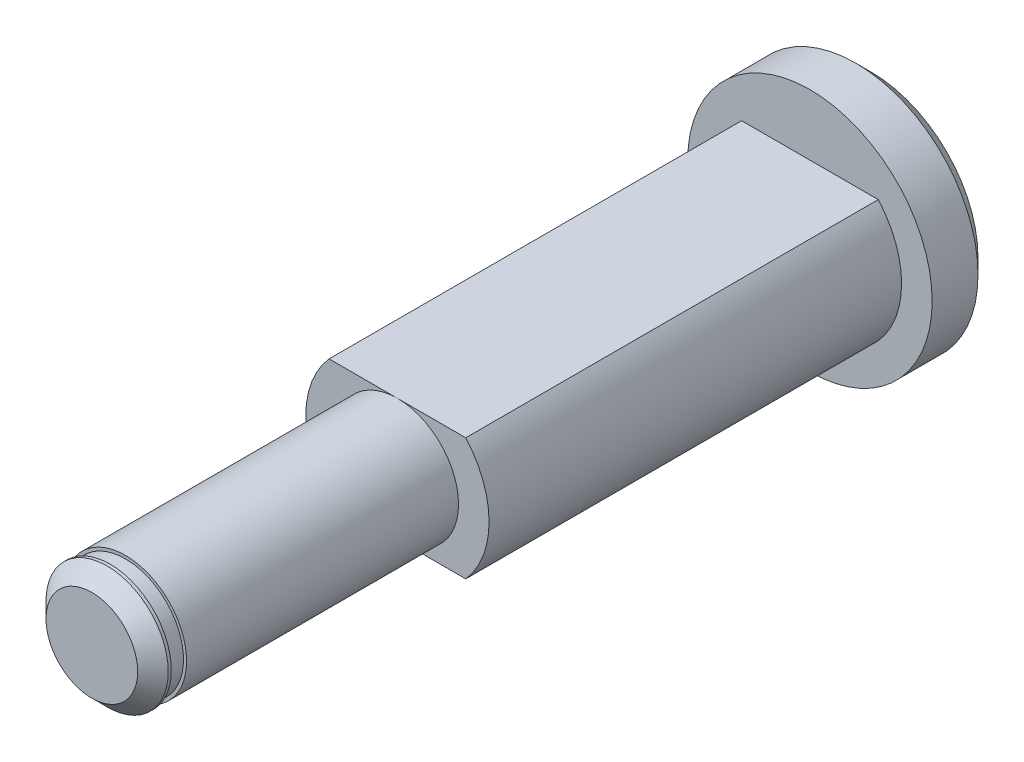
ISO-10303-21;
HEADER;
FILE_DESCRIPTION(('STEP AP214'),'2;1');
FILE_NAME('part.step','',(''),(''),'','','');
FILE_SCHEMA(('AUTOMOTIVE_DESIGN { 1 0 10303 214 1 1 1 1 }'));
ENDSEC;
DATA;
#1=APPLICATION_CONTEXT('core data for automotive mechanical design processes');
#2=APPLICATION_PROTOCOL_DEFINITION('international standard','automotive_design',2000,#1);
#3=PRODUCT_CONTEXT('',#1,'mechanical');
#4=PRODUCT('Part','Part','',(#3));
#5=PRODUCT_RELATED_PRODUCT_CATEGORY('part','',(#4));
#6=PRODUCT_DEFINITION_FORMATION('','',#4);
#7=PRODUCT_DEFINITION_CONTEXT('part definition',#1,'design');
#8=PRODUCT_DEFINITION('design','',#6,#7);
#9=PRODUCT_DEFINITION_SHAPE('','',#8);
#10=(LENGTH_UNIT() NAMED_UNIT(*) SI_UNIT(.MILLI.,.METRE.));
#11=(NAMED_UNIT(*) PLANE_ANGLE_UNIT() SI_UNIT($,.RADIAN.));
#12=(NAMED_UNIT(*) SI_UNIT($,.STERADIAN.) SOLID_ANGLE_UNIT());
#13=UNCERTAINTY_MEASURE_WITH_UNIT(LENGTH_MEASURE(1.E-05),#10,'distance_accuracy_value','');
#14=(GEOMETRIC_REPRESENTATION_CONTEXT(3) GLOBAL_UNCERTAINTY_ASSIGNED_CONTEXT((#13)) GLOBAL_UNIT_ASSIGNED_CONTEXT((#10,
#11,#12)) REPRESENTATION_CONTEXT('',''));
#15=CARTESIAN_POINT('',(0.,0.,0.));
#16=DIRECTION('',(0.,0.,1.));
#17=DIRECTION('',(1.,0.,0.));
#18=AXIS2_PLACEMENT_3D('',#15,#16,#17);
#19=CARTESIAN_POINT('',(0.,0.,0.));
#20=DIRECTION('',(0.,0.,1.));
#21=DIRECTION('',(1.,0.,0.));
#22=AXIS2_PLACEMENT_3D('',#19,#20,#21);
#23=PLANE('',#22);
#24=CARTESIAN_POINT('',(0.,0.,0.));
#25=DIRECTION('',(0.,0.,1.));
#26=DIRECTION('',(1.,0.,0.));
#27=AXIS2_PLACEMENT_3D('',#24,#25,#26);
#28=CIRCLE('',#27,3.);
#29=CARTESIAN_POINT('',(2.23606797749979,-2.,0.));
#30=VERTEX_POINT('',#29);
#31=CARTESIAN_POINT('',(2.23606797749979,2.,0.));
#32=VERTEX_POINT('',#31);
#33=EDGE_CURVE('E102',#30,#32,#28,.T.);
#34=ORIENTED_EDGE('',*,*,#33,.T.);
#35=DIRECTION('',(-1.,0.,0.));
#36=VECTOR('',#35,1.);
#37=CARTESIAN_POINT('',(-3.78673646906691,2.,0.));
#38=LINE('',#37,#36);
#39=CARTESIAN_POINT('',(0.,2.,0.));
#40=VERTEX_POINT('',#39);
#41=EDGE_CURVE('E90',#32,#40,#38,.T.);
#42=ORIENTED_EDGE('',*,*,#41,.T.);
#43=CARTESIAN_POINT('',(0.,0.,0.));
#44=DIRECTION('',(0.,0.,1.));
#45=DIRECTION('',(1.,0.,0.));
#46=AXIS2_PLACEMENT_3D('',#43,#44,#45);
#47=CIRCLE('',#46,2.);
#48=CARTESIAN_POINT('',(0.,-2.,0.));
#49=VERTEX_POINT('',#48);
#50=EDGE_CURVE('E100',#49,#40,#47,.T.);
#51=ORIENTED_EDGE('',*,*,#50,.F.);
#52=DIRECTION('',(1.,0.,0.));
#53=VECTOR('',#52,1.);
#54=CARTESIAN_POINT('',(-3.78673646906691,-2.,0.));
#55=LINE('',#54,#53);
#56=EDGE_CURVE('E204',#49,#30,#55,.T.);
#57=ORIENTED_EDGE('',*,*,#56,.T.);
#58=EDGE_LOOP('',(#34,#42,#51,#57));
#59=FACE_BOUND('',#58,.T.);
#60=ADVANCED_FACE('F33',(#59),#23,.T.);
#61=EDGE_CURVE('E106',#40,#49,#47,.T.);
#62=ORIENTED_EDGE('',*,*,#61,.F.);
#63=CARTESIAN_POINT('',(-2.23606797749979,2.,0.));
#64=VERTEX_POINT('',#63);
#65=EDGE_CURVE('E199',#40,#64,#38,.T.);
#66=ORIENTED_EDGE('',*,*,#65,.T.);
#67=CARTESIAN_POINT('',(-2.23606797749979,-2.,0.));
#68=VERTEX_POINT('',#67);
#69=EDGE_CURVE('E98',#64,#68,#28,.T.);
#70=ORIENTED_EDGE('',*,*,#69,.T.);
#71=EDGE_CURVE('E201',#68,#49,#55,.T.);
#72=ORIENTED_EDGE('',*,*,#71,.T.);
#73=EDGE_LOOP('',(#62,#66,#70,#72));
#74=FACE_BOUND('',#73,.T.);
#75=ADVANCED_FACE('F143',(#74),#23,.T.);
#76=CARTESIAN_POINT('',(0.,0.,-13.5));
#77=DIRECTION('',(0.,0.,1.));
#78=DIRECTION('',(1.,0.,0.));
#79=AXIS2_PLACEMENT_3D('',#76,#77,#78);
#80=CYLINDRICAL_SURFACE('',#79,3.);
#81=ORIENTED_EDGE('',*,*,#69,.F.);
#82=DIRECTION('',(0.,0.,1.));
#83=VECTOR('',#82,1.);
#84=CARTESIAN_POINT('',(-2.23606797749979,2.,-13.5));
#85=LINE('',#84,#83);
#86=CARTESIAN_POINT('',(-2.23606797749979,2.,-13.5));
#87=VERTEX_POINT('',#86);
#88=EDGE_CURVE('E55',#64,#87,#85,.F.);
#89=ORIENTED_EDGE('',*,*,#88,.T.);
#90=CARTESIAN_POINT('',(0.,0.,-13.5));
#91=DIRECTION('',(0.,0.,1.));
#92=DIRECTION('',(1.,0.,0.));
#93=AXIS2_PLACEMENT_3D('',#90,#91,#92);
#94=CIRCLE('',#93,3.);
#95=CARTESIAN_POINT('',(-2.23606797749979,-2.,-13.5));
#96=VERTEX_POINT('',#95);
#97=EDGE_CURVE('E48',#87,#96,#94,.T.);
#98=ORIENTED_EDGE('',*,*,#97,.T.);
#99=DIRECTION('',(0.,0.,1.));
#100=VECTOR('',#99,1.);
#101=CARTESIAN_POINT('',(-2.23606797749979,-2.,-13.5));
#102=LINE('',#101,#100);
#103=EDGE_CURVE('E207',#96,#68,#102,.T.);
#104=ORIENTED_EDGE('',*,*,#103,.T.);
#105=EDGE_LOOP('',(#81,#89,#98,#104));
#106=FACE_BOUND('',#105,.T.);
#107=ADVANCED_FACE('F149',(#106),#80,.T.);
#108=CARTESIAN_POINT('',(2.23606797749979,-2.,-13.5));
#109=VERTEX_POINT('',#108);
#110=CARTESIAN_POINT('',(2.23606797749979,2.,-13.5));
#111=VERTEX_POINT('',#110);
#112=EDGE_CURVE('E82',#109,#111,#94,.T.);
#113=ORIENTED_EDGE('',*,*,#112,.T.);
#114=DIRECTION('',(0.,0.,1.));
#115=VECTOR('',#114,1.);
#116=CARTESIAN_POINT('',(2.23606797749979,2.,-13.5));
#117=LINE('',#116,#115);
#118=EDGE_CURVE('E87',#111,#32,#117,.T.);
#119=ORIENTED_EDGE('',*,*,#118,.T.);
#120=ORIENTED_EDGE('',*,*,#33,.F.);
#121=DIRECTION('',(0.,0.,1.));
#122=VECTOR('',#121,1.);
#123=CARTESIAN_POINT('',(2.23606797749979,-2.,-13.5));
#124=LINE('',#123,#122);
#125=EDGE_CURVE('E94',#30,#109,#124,.F.);
#126=ORIENTED_EDGE('',*,*,#125,.T.);
#127=EDGE_LOOP('',(#113,#119,#120,#126));
#128=FACE_BOUND('',#127,.T.);
#129=ADVANCED_FACE('F97',(#128),#80,.T.);
#130=CARTESIAN_POINT('',(0.,0.,10.));
#131=DIRECTION('',(0.,0.,-1.));
#132=DIRECTION('',(-1.,0.,0.));
#133=AXIS2_PLACEMENT_3D('',#130,#131,#132);
#134=CYLINDRICAL_SURFACE('',#133,2.);
#135=CARTESIAN_POINT('',(0.,0.,9.4));
#136=DIRECTION('',(0.,0.,1.));
#137=DIRECTION('',(1.,0.,0.));
#138=AXIS2_PLACEMENT_3D('',#135,#136,#137);
#139=CIRCLE('',#138,2.);
#140=CARTESIAN_POINT('',(2.,0.,9.4));
#141=VERTEX_POINT('',#140);
#142=EDGE_CURVE('E116',#141,#141,#139,.T.);
#143=ORIENTED_EDGE('',*,*,#142,.T.);
#144=EDGE_LOOP('',(#143));
#145=FACE_BOUND('',#144,.T.);
#146=CARTESIAN_POINT('',(0.,0.,9.49999999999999));
#147=DIRECTION('',(0.,0.,1.));
#148=DIRECTION('',(1.,0.,0.));
#149=AXIS2_PLACEMENT_3D('',#146,#147,#148);
#150=CIRCLE('',#149,2.);
#151=CARTESIAN_POINT('',(2.,0.,9.49999999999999));
#152=VERTEX_POINT('',#151);
#153=EDGE_CURVE('E120',#152,#152,#150,.F.);
#154=ORIENTED_EDGE('',*,*,#153,.T.);
#155=EDGE_LOOP('',(#154));
#156=FACE_BOUND('',#155,.T.);
#157=ADVANCED_FACE('F35',(#145,#156),#134,.T.);
#158=CARTESIAN_POINT('',(0.,0.,10.));
#159=DIRECTION('',(0.,0.,1.));
#160=DIRECTION('',(1.,0.,0.));
#161=AXIS2_PLACEMENT_3D('',#158,#159,#160);
#162=PLANE('',#161);
#163=CARTESIAN_POINT('',(0.,0.,10.));
#164=DIRECTION('',(0.,0.,1.));
#165=DIRECTION('',(1.,0.,0.));
#166=AXIS2_PLACEMENT_3D('',#163,#164,#165);
#167=CIRCLE('',#166,1.5);
#168=CARTESIAN_POINT('',(1.5,0.,10.));
#169=VERTEX_POINT('',#168);
#170=EDGE_CURVE('E117',#169,#169,#167,.T.);
#171=ORIENTED_EDGE('',*,*,#170,.T.);
#172=EDGE_LOOP('',(#171));
#173=FACE_BOUND('',#172,.T.);
#174=ADVANCED_FACE('F173',(#173),#162,.T.);
#175=CARTESIAN_POINT('',(0.,0.,10.));
#176=DIRECTION('',(0.,0.,-1.));
#177=DIRECTION('',(-1.,0.,0.));
#178=AXIS2_PLACEMENT_3D('',#175,#176,#177);
#179=CONICAL_SURFACE('',#178,1.5,0.785398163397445);
#180=ORIENTED_EDGE('',*,*,#153,.F.);
#181=EDGE_LOOP('',(#180));
#182=FACE_BOUND('',#181,.T.);
#183=ORIENTED_EDGE('',*,*,#170,.F.);
#184=EDGE_LOOP('',(#183));
#185=FACE_BOUND('',#184,.T.);
#186=ADVANCED_FACE('F170',(#182,#185),#179,.T.);
#187=CARTESIAN_POINT('',(0.,2.30718163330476,8.9));
#188=DIRECTION('',(0.,0.,-1.));
#189=DIRECTION('',(-1.,0.,0.));
#190=AXIS2_PLACEMENT_3D('',#187,#188,#189);
#191=PLANE('',#190);
#192=CARTESIAN_POINT('',(0.,0.,8.9));
#193=DIRECTION('',(0.,0.,-1.));
#194=DIRECTION('',(-1.,0.,0.));
#195=AXIS2_PLACEMENT_3D('',#192,#193,#194);
#196=CIRCLE('',#195,1.9);
#197=CARTESIAN_POINT('',(-1.9,0.,8.9));
#198=VERTEX_POINT('',#197);
#199=EDGE_CURVE('E113',#198,#198,#196,.T.);
#200=ORIENTED_EDGE('',*,*,#199,.T.);
#201=EDGE_LOOP('',(#200));
#202=FACE_BOUND('',#201,.T.);
#203=CARTESIAN_POINT('',(0.,0.,8.9));
#204=DIRECTION('',(0.,0.,-1.));
#205=DIRECTION('',(-1.,0.,0.));
#206=AXIS2_PLACEMENT_3D('',#203,#204,#205);
#207=CIRCLE('',#206,2.);
#208=CARTESIAN_POINT('',(-2.,0.,8.9));
#209=VERTEX_POINT('',#208);
#210=EDGE_CURVE('E121',#209,#209,#207,.T.);
#211=ORIENTED_EDGE('',*,*,#210,.F.);
#212=EDGE_LOOP('',(#211));
#213=FACE_BOUND('',#212,.T.);
#214=ADVANCED_FACE('F162',(#202,#213),#191,.F.);
#215=CARTESIAN_POINT('',(0.,2.30718163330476,9.4));
#216=DIRECTION('',(0.,0.,1.));
#217=DIRECTION('',(1.,0.,0.));
#218=AXIS2_PLACEMENT_3D('',#215,#216,#217);
#219=PLANE('',#218);
#220=CARTESIAN_POINT('',(0.,0.,9.4));
#221=DIRECTION('',(0.,0.,-1.));
#222=DIRECTION('',(-1.,0.,0.));
#223=AXIS2_PLACEMENT_3D('',#220,#221,#222);
#224=CIRCLE('',#223,1.9);
#225=CARTESIAN_POINT('',(-1.9,0.,9.4));
#226=VERTEX_POINT('',#225);
#227=EDGE_CURVE('E109',#226,#226,#224,.T.);
#228=ORIENTED_EDGE('',*,*,#227,.F.);
#229=EDGE_LOOP('',(#228));
#230=FACE_BOUND('',#229,.T.);
#231=ORIENTED_EDGE('',*,*,#142,.F.);
#232=EDGE_LOOP('',(#231));
#233=FACE_BOUND('',#232,.T.);
#234=ADVANCED_FACE('F158',(#230,#233),#219,.F.);
#235=CARTESIAN_POINT('',(0.,0.,0.));
#236=DIRECTION('',(0.,0.,-1.));
#237=DIRECTION('',(-1.,0.,0.));
#238=AXIS2_PLACEMENT_3D('',#235,#236,#237);
#239=CYLINDRICAL_SURFACE('',#238,1.9);
#240=ORIENTED_EDGE('',*,*,#199,.F.);
#241=EDGE_LOOP('',(#240));
#242=FACE_BOUND('',#241,.T.);
#243=ORIENTED_EDGE('',*,*,#227,.T.);
#244=EDGE_LOOP('',(#243));
#245=FACE_BOUND('',#244,.T.);
#246=ADVANCED_FACE('F161',(#242,#245),#239,.T.);
#247=ORIENTED_EDGE('',*,*,#210,.T.);
#248=EDGE_LOOP('',(#247));
#249=FACE_BOUND('',#248,.T.);
#250=ORIENTED_EDGE('',*,*,#61,.T.);
#251=ORIENTED_EDGE('',*,*,#50,.T.);
#252=EDGE_LOOP('',(#250,#251));
#253=FACE_BOUND('',#252,.T.);
#254=ADVANCED_FACE('F166',(#249,#253),#134,.T.);
#255=CARTESIAN_POINT('',(-3.78673646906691,-2.,-13.5));
#256=DIRECTION('',(0.,-1.,0.));
#257=DIRECTION('',(0.,0.,-1.));
#258=AXIS2_PLACEMENT_3D('',#255,#256,#257);
#259=PLANE('',#258);
#260=ORIENTED_EDGE('',*,*,#56,.F.);
#261=ORIENTED_EDGE('',*,*,#71,.F.);
#262=ORIENTED_EDGE('',*,*,#103,.F.);
#263=DIRECTION('',(1.,0.,0.));
#264=VECTOR('',#263,1.);
#265=CARTESIAN_POINT('',(0.,-2.,-13.5));
#266=LINE('',#265,#264);
#267=EDGE_CURVE('E84',#96,#109,#266,.T.);
#268=ORIENTED_EDGE('',*,*,#267,.T.);
#269=ORIENTED_EDGE('',*,*,#125,.F.);
#270=EDGE_LOOP('',(#260,#261,#262,#268,#269));
#271=FACE_BOUND('',#270,.T.);
#272=ADVANCED_FACE('F153',(#271),#259,.T.);
#273=CARTESIAN_POINT('',(-3.78673646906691,2.,-13.5));
#274=DIRECTION('',(0.,1.,0.));
#275=DIRECTION('',(0.,0.,1.));
#276=AXIS2_PLACEMENT_3D('',#273,#274,#275);
#277=PLANE('',#276);
#278=ORIENTED_EDGE('',*,*,#65,.F.);
#279=ORIENTED_EDGE('',*,*,#41,.F.);
#280=ORIENTED_EDGE('',*,*,#118,.F.);
#281=DIRECTION('',(-1.,0.,0.));
#282=VECTOR('',#281,1.);
#283=CARTESIAN_POINT('',(0.,2.,-13.5));
#284=LINE('',#283,#282);
#285=EDGE_CURVE('E77',#111,#87,#284,.T.);
#286=ORIENTED_EDGE('',*,*,#285,.T.);
#287=ORIENTED_EDGE('',*,*,#88,.F.);
#288=EDGE_LOOP('',(#278,#279,#280,#286,#287));
#289=FACE_BOUND('',#288,.T.);
#290=ADVANCED_FACE('F88',(#289),#277,.T.);
#291=CARTESIAN_POINT('',(0.,0.,-15.5));
#292=DIRECTION('',(0.,0.,1.));
#293=DIRECTION('',(1.,0.,0.));
#294=AXIS2_PLACEMENT_3D('',#291,#292,#293);
#295=CYLINDRICAL_SURFACE('',#294,4.);
#296=CARTESIAN_POINT('',(0.,0.,-15.));
#297=DIRECTION('',(0.,0.,-1.));
#298=DIRECTION('',(-1.,0.,0.));
#299=AXIS2_PLACEMENT_3D('',#296,#297,#298);
#300=CIRCLE('',#299,4.);
#301=CARTESIAN_POINT('',(-4.,0.,-15.));
#302=VERTEX_POINT('',#301);
#303=EDGE_CURVE('E12',#302,#302,#300,.F.);
#304=ORIENTED_EDGE('',*,*,#303,.T.);
#305=EDGE_LOOP('',(#304));
#306=FACE_BOUND('',#305,.T.);
#307=CARTESIAN_POINT('',(0.,0.,-13.5));
#308=DIRECTION('',(0.,0.,-1.));
#309=DIRECTION('',(-1.,0.,0.));
#310=AXIS2_PLACEMENT_3D('',#307,#308,#309);
#311=CIRCLE('',#310,4.);
#312=CARTESIAN_POINT('',(-4.,0.,-13.5));
#313=VERTEX_POINT('',#312);
#314=EDGE_CURVE('E212',#313,#313,#311,.T.);
#315=ORIENTED_EDGE('',*,*,#314,.T.);
#316=EDGE_LOOP('',(#315));
#317=FACE_BOUND('',#316,.T.);
#318=ADVANCED_FACE('F216',(#306,#317),#295,.T.);
#319=CARTESIAN_POINT('',(0.,0.,-15.5));
#320=DIRECTION('',(0.,0.,-1.));
#321=DIRECTION('',(-1.,0.,0.));
#322=AXIS2_PLACEMENT_3D('',#319,#320,#321);
#323=PLANE('',#322);
#324=CARTESIAN_POINT('',(0.,0.,-15.5));
#325=DIRECTION('',(0.,0.,-1.));
#326=DIRECTION('',(-1.,0.,0.));
#327=AXIS2_PLACEMENT_3D('',#324,#325,#326);
#328=CIRCLE('',#327,3.5);
#329=CARTESIAN_POINT('',(-3.5,0.,-15.5));
#330=VERTEX_POINT('',#329);
#331=EDGE_CURVE('E41',#330,#330,#328,.T.);
#332=ORIENTED_EDGE('',*,*,#331,.T.);
#333=EDGE_LOOP('',(#332));
#334=FACE_BOUND('',#333,.T.);
#335=ADVANCED_FACE('F131',(#334),#323,.T.);
#336=CARTESIAN_POINT('',(0.,0.,-13.5));
#337=DIRECTION('',(0.,0.,-1.));
#338=DIRECTION('',(-1.,0.,0.));
#339=AXIS2_PLACEMENT_3D('',#336,#337,#338);
#340=PLANE('',#339);
#341=ORIENTED_EDGE('',*,*,#267,.F.);
#342=ORIENTED_EDGE('',*,*,#97,.F.);
#343=ORIENTED_EDGE('',*,*,#285,.F.);
#344=ORIENTED_EDGE('',*,*,#112,.F.);
#345=EDGE_LOOP('',(#341,#342,#343,#344));
#346=FACE_BOUND('',#345,.T.);
#347=ORIENTED_EDGE('',*,*,#314,.F.);
#348=EDGE_LOOP('',(#347));
#349=FACE_BOUND('',#348,.T.);
#350=ADVANCED_FACE('F79',(#346,#349),#340,.F.);
#351=CARTESIAN_POINT('',(0.,0.,-15.5));
#352=DIRECTION('',(0.,0.,1.));
#353=DIRECTION('',(1.,0.,0.));
#354=AXIS2_PLACEMENT_3D('',#351,#352,#353);
#355=CONICAL_SURFACE('',#354,3.5,0.785398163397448);
#356=ORIENTED_EDGE('',*,*,#303,.F.);
#357=EDGE_LOOP('',(#356));
#358=FACE_BOUND('',#357,.T.);
#359=ORIENTED_EDGE('',*,*,#331,.F.);
#360=EDGE_LOOP('',(#359));
#361=FACE_BOUND('',#360,.T.);
#362=ADVANCED_FACE('F133',(#358,#361),#355,.T.);
#363=CLOSED_SHELL('',(#60,#75,#107,#129,#157,#174,#186,#214,#234,#246,#254,#272,#290,#318,#335,
#350,#362));
#364=MANIFOLD_SOLID_BREP('B2',#363);
#365=ADVANCED_BREP_SHAPE_REPRESENTATION('',(#18,#364),#14);
#366=SHAPE_DEFINITION_REPRESENTATION(#9,#365);
ENDSEC;
END-ISO-10303-21;
